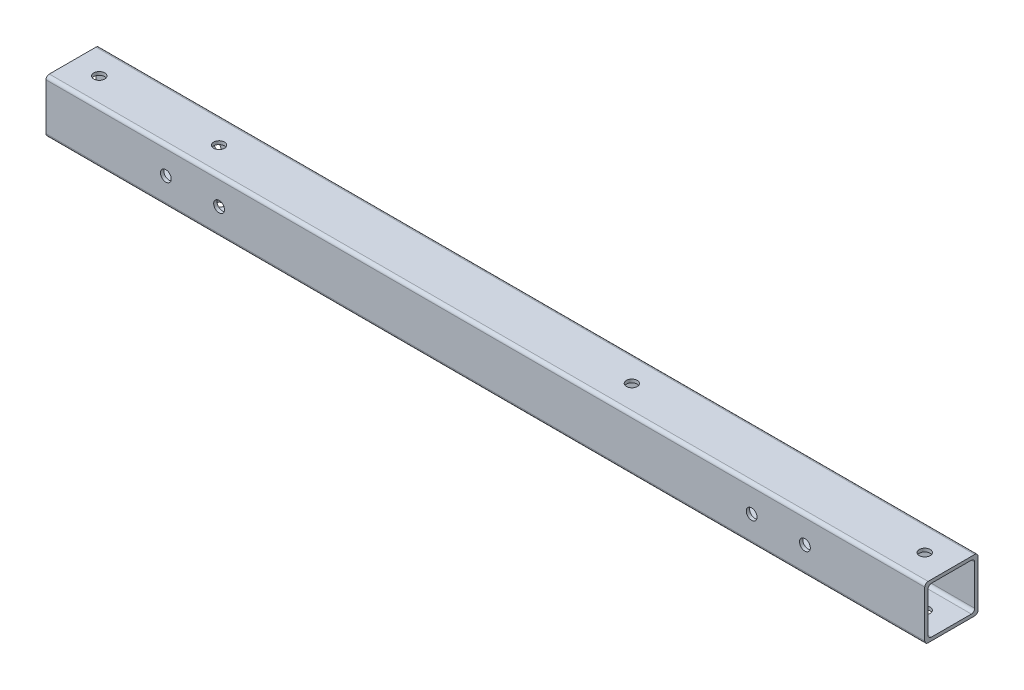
ISO-10303-21;
HEADER;
FILE_DESCRIPTION(('STEP AP214'),'2;1');
FILE_NAME('part.step','',(''),(''),'','','');
FILE_SCHEMA(('AUTOMOTIVE_DESIGN { 1 0 10303 214 1 1 1 1 }'));
ENDSEC;
DATA;
#1=APPLICATION_CONTEXT('core data for automotive mechanical design processes');
#2=APPLICATION_PROTOCOL_DEFINITION('international standard','automotive_design',2000,#1);
#3=PRODUCT_CONTEXT('',#1,'mechanical');
#4=PRODUCT('Part','Part','',(#3));
#5=PRODUCT_RELATED_PRODUCT_CATEGORY('part','',(#4));
#6=PRODUCT_DEFINITION_FORMATION('','',#4);
#7=PRODUCT_DEFINITION_CONTEXT('part definition',#1,'design');
#8=PRODUCT_DEFINITION('design','',#6,#7);
#9=PRODUCT_DEFINITION_SHAPE('','',#8);
#10=(LENGTH_UNIT() NAMED_UNIT(*) SI_UNIT(.MILLI.,.METRE.));
#11=(NAMED_UNIT(*) PLANE_ANGLE_UNIT() SI_UNIT($,.RADIAN.));
#12=(NAMED_UNIT(*) SI_UNIT($,.STERADIAN.) SOLID_ANGLE_UNIT());
#13=UNCERTAINTY_MEASURE_WITH_UNIT(LENGTH_MEASURE(1.E-05),#10,'distance_accuracy_value','');
#14=(GEOMETRIC_REPRESENTATION_CONTEXT(3) GLOBAL_UNCERTAINTY_ASSIGNED_CONTEXT((#13)) GLOBAL_UNIT_ASSIGNED_CONTEXT((#10,
#11,#12)) REPRESENTATION_CONTEXT('',''));
#15=CARTESIAN_POINT('',(0.,0.,0.));
#16=DIRECTION('',(0.,0.,1.));
#17=DIRECTION('',(1.,0.,0.));
#18=AXIS2_PLACEMENT_3D('',#15,#16,#17);
#19=CARTESIAN_POINT('',(0.,101.6,0.));
#20=DIRECTION('',(0.,0.,1.));
#21=DIRECTION('',(1.,0.,0.));
#22=AXIS2_PLACEMENT_3D('',#19,#20,#21);
#23=PLANE('',#22);
#24=CARTESIAN_POINT('',(-228.6,50.8,1.77298507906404E-13));
#25=DIRECTION('',(0.,0.,1.));
#26=DIRECTION('',(1.,0.,0.));
#27=AXIS2_PLACEMENT_3D('',#24,#25,#26);
#28=CIRCLE('',#27,10.31875);
#29=CARTESIAN_POINT('',(-218.28125,50.8,1.78562148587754E-13));
#30=VERTEX_POINT('',#29);
#31=EDGE_CURVE('E238',#30,#30,#28,.T.);
#32=ORIENTED_EDGE('',*,*,#31,.T.);
#33=EDGE_LOOP('',(#32));
#34=FACE_BOUND('',#33,.T.);
#35=CARTESIAN_POINT('',(-1346.2,50.8,1.64856507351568E-13));
#36=DIRECTION('',(0.,0.,-1.));
#37=DIRECTION('',(-1.,0.,0.));
#38=AXIS2_PLACEMENT_3D('',#35,#36,#37);
#39=CIRCLE('',#38,10.31875);
#40=CARTESIAN_POINT('',(-1356.51875,50.8,1.66120148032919E-13));
#41=VERTEX_POINT('',#40);
#42=EDGE_CURVE('E252',#41,#41,#39,.T.);
#43=ORIENTED_EDGE('',*,*,#42,.F.);
#44=EDGE_LOOP('',(#43));
#45=FACE_BOUND('',#44,.T.);
#46=CARTESIAN_POINT('',(-1447.8,50.8,1.77298507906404E-13));
#47=DIRECTION('',(0.,0.,-1.));
#48=DIRECTION('',(-1.,0.,0.));
#49=AXIS2_PLACEMENT_3D('',#46,#47,#48);
#50=CIRCLE('',#49,10.31875);
#51=CARTESIAN_POINT('',(-1458.11875,50.8,1.78562148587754E-13));
#52=VERTEX_POINT('',#51);
#53=EDGE_CURVE('E259',#52,#52,#50,.T.);
#54=ORIENTED_EDGE('',*,*,#53,.F.);
#55=EDGE_LOOP('',(#54));
#56=FACE_BOUND('',#55,.T.);
#57=DIRECTION('',(0.,-1.,0.));
#58=VECTOR('',#57,1.);
#59=CARTESIAN_POINT('',(-1676.4,101.6,2.05293009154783E-13));
#60=LINE('',#59,#58);
#61=CARTESIAN_POINT('',(-1676.4,95.25,2.05293009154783E-13));
#62=VERTEX_POINT('',#61);
#63=CARTESIAN_POINT('',(-1676.4,6.34999999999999,2.05293009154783E-13));
#64=VERTEX_POINT('',#63);
#65=EDGE_CURVE('E310',#62,#64,#60,.T.);
#66=ORIENTED_EDGE('',*,*,#65,.F.);
#67=DIRECTION('',(-1.,0.,0.));
#68=VECTOR('',#67,1.);
#69=CARTESIAN_POINT('',(0.,95.25,0.));
#70=LINE('',#69,#68);
#71=CARTESIAN_POINT('',(0.,95.25,0.));
#72=VERTEX_POINT('',#71);
#73=EDGE_CURVE('E361',#62,#72,#70,.F.);
#74=ORIENTED_EDGE('',*,*,#73,.T.);
#75=DIRECTION('',(0.,-1.,0.));
#76=VECTOR('',#75,1.);
#77=CARTESIAN_POINT('',(0.,101.6,0.));
#78=LINE('',#77,#76);
#79=CARTESIAN_POINT('',(0.,6.34999999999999,0.));
#80=VERTEX_POINT('',#79);
#81=EDGE_CURVE('E160',#72,#80,#78,.T.);
#82=ORIENTED_EDGE('',*,*,#81,.T.);
#83=DIRECTION('',(-1.,0.,0.));
#84=VECTOR('',#83,1.);
#85=CARTESIAN_POINT('',(-1676.4,6.34999999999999,2.05293009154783E-13));
#86=LINE('',#85,#84);
#87=EDGE_CURVE('E359',#80,#64,#86,.T.);
#88=ORIENTED_EDGE('',*,*,#87,.T.);
#89=EDGE_LOOP('',(#66,#74,#82,#88));
#90=FACE_BOUND('',#89,.T.);
#91=CARTESIAN_POINT('',(-330.2,50.8,1.64856507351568E-13));
#92=DIRECTION('',(0.,0.,1.));
#93=DIRECTION('',(1.,0.,0.));
#94=AXIS2_PLACEMENT_3D('',#91,#92,#93);
#95=CIRCLE('',#94,10.31875);
#96=CARTESIAN_POINT('',(-319.88125,50.8,1.66120148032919E-13));
#97=VERTEX_POINT('',#96);
#98=EDGE_CURVE('E219',#97,#97,#95,.T.);
#99=ORIENTED_EDGE('',*,*,#98,.T.);
#100=EDGE_LOOP('',(#99));
#101=FACE_BOUND('',#100,.T.);
#102=ADVANCED_FACE('F31',(#34,#45,#56,#90,#101),#23,.F.);
#103=CARTESIAN_POINT('',(0.,101.6,101.6));
#104=DIRECTION('',(0.,0.,-1.));
#105=DIRECTION('',(-1.,0.,0.));
#106=AXIS2_PLACEMENT_3D('',#103,#104,#105);
#107=PLANE('',#106);
#108=CARTESIAN_POINT('',(-228.6,50.8,101.6));
#109=DIRECTION('',(0.,0.,1.));
#110=DIRECTION('',(1.,0.,0.));
#111=AXIS2_PLACEMENT_3D('',#108,#109,#110);
#112=CIRCLE('',#111,10.31875);
#113=CARTESIAN_POINT('',(-218.28125,50.8,101.6));
#114=VERTEX_POINT('',#113);
#115=EDGE_CURVE('E207',#114,#114,#112,.T.);
#116=ORIENTED_EDGE('',*,*,#115,.F.);
#117=EDGE_LOOP('',(#116));
#118=FACE_BOUND('',#117,.T.);
#119=CARTESIAN_POINT('',(-1346.2,50.8,101.6));
#120=DIRECTION('',(0.,0.,-1.));
#121=DIRECTION('',(-1.,0.,0.));
#122=AXIS2_PLACEMENT_3D('',#119,#120,#121);
#123=CIRCLE('',#122,10.31875);
#124=CARTESIAN_POINT('',(-1356.51875,50.8,101.6));
#125=VERTEX_POINT('',#124);
#126=EDGE_CURVE('E197',#125,#125,#123,.T.);
#127=ORIENTED_EDGE('',*,*,#126,.T.);
#128=EDGE_LOOP('',(#127));
#129=FACE_BOUND('',#128,.T.);
#130=CARTESIAN_POINT('',(-1447.8,50.8,101.6));
#131=DIRECTION('',(0.,0.,-1.));
#132=DIRECTION('',(-1.,0.,0.));
#133=AXIS2_PLACEMENT_3D('',#130,#131,#132);
#134=CIRCLE('',#133,10.31875);
#135=CARTESIAN_POINT('',(-1458.11875,50.8,101.6));
#136=VERTEX_POINT('',#135);
#137=EDGE_CURVE('E192',#136,#136,#134,.T.);
#138=ORIENTED_EDGE('',*,*,#137,.T.);
#139=EDGE_LOOP('',(#138));
#140=FACE_BOUND('',#139,.T.);
#141=DIRECTION('',(0.,-1.,0.));
#142=VECTOR('',#141,1.);
#143=CARTESIAN_POINT('',(-1676.4,101.6,101.6));
#144=LINE('',#143,#142);
#145=CARTESIAN_POINT('',(-1676.4,95.25,101.6));
#146=VERTEX_POINT('',#145);
#147=CARTESIAN_POINT('',(-1676.4,6.34999999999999,101.6));
#148=VERTEX_POINT('',#147);
#149=EDGE_CURVE('E307',#146,#148,#144,.T.);
#150=ORIENTED_EDGE('',*,*,#149,.T.);
#151=DIRECTION('',(1.,0.,0.));
#152=VECTOR('',#151,1.);
#153=CARTESIAN_POINT('',(0.,6.34999999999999,101.6));
#154=LINE('',#153,#152);
#155=CARTESIAN_POINT('',(0.,6.34999999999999,101.6));
#156=VERTEX_POINT('',#155);
#157=EDGE_CURVE('E324',#148,#156,#154,.T.);
#158=ORIENTED_EDGE('',*,*,#157,.T.);
#159=DIRECTION('',(0.,-1.,0.));
#160=VECTOR('',#159,1.);
#161=CARTESIAN_POINT('',(0.,101.6,101.6));
#162=LINE('',#161,#160);
#163=CARTESIAN_POINT('',(0.,95.25,101.6));
#164=VERTEX_POINT('',#163);
#165=EDGE_CURVE('E300',#164,#156,#162,.T.);
#166=ORIENTED_EDGE('',*,*,#165,.F.);
#167=DIRECTION('',(1.,0.,0.));
#168=VECTOR('',#167,1.);
#169=CARTESIAN_POINT('',(0.,95.25,101.6));
#170=LINE('',#169,#168);
#171=EDGE_CURVE('E322',#164,#146,#170,.F.);
#172=ORIENTED_EDGE('',*,*,#171,.T.);
#173=EDGE_LOOP('',(#150,#158,#166,#172));
#174=FACE_BOUND('',#173,.T.);
#175=CARTESIAN_POINT('',(-330.2,50.8,101.6));
#176=DIRECTION('',(0.,0.,1.));
#177=DIRECTION('',(1.,0.,0.));
#178=AXIS2_PLACEMENT_3D('',#175,#176,#177);
#179=CIRCLE('',#178,10.31875);
#180=CARTESIAN_POINT('',(-319.88125,50.8,101.6));
#181=VERTEX_POINT('',#180);
#182=EDGE_CURVE('E211',#181,#181,#179,.T.);
#183=ORIENTED_EDGE('',*,*,#182,.F.);
#184=EDGE_LOOP('',(#183));
#185=FACE_BOUND('',#184,.T.);
#186=ADVANCED_FACE('F390',(#118,#129,#140,#174,#185),#107,.F.);
#187=CARTESIAN_POINT('',(0.000999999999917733,95.25,6.35000000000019));
#188=DIRECTION('',(0.,0.,-1.));
#189=DIRECTION('',(0.,1.,0.));
#190=AXIS2_PLACEMENT_3D('',#187,#188,#189);
#191=PLANE('',#190);
#192=CARTESIAN_POINT('',(-228.6,50.8,6.3500000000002));
#193=DIRECTION('',(0.,0.,-1.));
#194=DIRECTION('',(0.,1.,0.));
#195=AXIS2_PLACEMENT_3D('',#192,#193,#194);
#196=CIRCLE('',#195,10.31875);
#197=CARTESIAN_POINT('',(-228.6,61.11875,6.3500000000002));
#198=VERTEX_POINT('',#197);
#199=EDGE_CURVE('E206',#198,#198,#196,.F.);
#200=ORIENTED_EDGE('',*,*,#199,.F.);
#201=EDGE_LOOP('',(#200));
#202=FACE_BOUND('',#201,.T.);
#203=CARTESIAN_POINT('',(-1346.2,50.8,6.3500000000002));
#204=DIRECTION('',(0.,0.,-1.));
#205=DIRECTION('',(0.,1.,0.));
#206=AXIS2_PLACEMENT_3D('',#203,#204,#205);
#207=CIRCLE('',#206,10.31875);
#208=CARTESIAN_POINT('',(-1346.2,61.11875,6.3500000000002));
#209=VERTEX_POINT('',#208);
#210=EDGE_CURVE('E196',#209,#209,#207,.T.);
#211=ORIENTED_EDGE('',*,*,#210,.T.);
#212=EDGE_LOOP('',(#211));
#213=FACE_BOUND('',#212,.T.);
#214=CARTESIAN_POINT('',(-1447.8,50.8,6.3500000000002));
#215=DIRECTION('',(0.,0.,-1.));
#216=DIRECTION('',(0.,1.,0.));
#217=AXIS2_PLACEMENT_3D('',#214,#215,#216);
#218=CIRCLE('',#217,10.31875);
#219=CARTESIAN_POINT('',(-1447.8,61.11875,6.3500000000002));
#220=VERTEX_POINT('',#219);
#221=EDGE_CURVE('E191',#220,#220,#218,.T.);
#222=ORIENTED_EDGE('',*,*,#221,.T.);
#223=EDGE_LOOP('',(#222));
#224=FACE_BOUND('',#223,.T.);
#225=DIRECTION('',(0.,1.,0.));
#226=VECTOR('',#225,1.);
#227=CARTESIAN_POINT('',(0.,95.25,6.35000000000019));
#228=LINE('',#227,#226);
#229=CARTESIAN_POINT('',(0.,12.7,6.3500000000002));
#230=VERTEX_POINT('',#229);
#231=CARTESIAN_POINT('',(0.,88.9,6.35000000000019));
#232=VERTEX_POINT('',#231);
#233=EDGE_CURVE('E276',#230,#232,#228,.T.);
#234=ORIENTED_EDGE('',*,*,#233,.T.);
#235=DIRECTION('',(-1.,0.,0.));
#236=VECTOR('',#235,1.);
#237=CARTESIAN_POINT('',(-1676.4,88.9,6.35000000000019));
#238=LINE('',#237,#236);
#239=CARTESIAN_POINT('',(-1676.4,88.9,6.35000000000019));
#240=VERTEX_POINT('',#239);
#241=EDGE_CURVE('E356',#232,#240,#238,.T.);
#242=ORIENTED_EDGE('',*,*,#241,.T.);
#243=DIRECTION('',(0.,-1.,0.));
#244=VECTOR('',#243,1.);
#245=CARTESIAN_POINT('',(-1676.4,95.25,6.35000000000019));
#246=LINE('',#245,#244);
#247=CARTESIAN_POINT('',(-1676.4,12.7,6.3500000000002));
#248=VERTEX_POINT('',#247);
#249=EDGE_CURVE('E279',#240,#248,#246,.T.);
#250=ORIENTED_EDGE('',*,*,#249,.T.);
#251=DIRECTION('',(-1.,0.,0.));
#252=VECTOR('',#251,1.);
#253=CARTESIAN_POINT('',(0.,12.7,6.3500000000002));
#254=LINE('',#253,#252);
#255=EDGE_CURVE('E354',#248,#230,#254,.F.);
#256=ORIENTED_EDGE('',*,*,#255,.T.);
#257=EDGE_LOOP('',(#234,#242,#250,#256));
#258=FACE_BOUND('',#257,.T.);
#259=CARTESIAN_POINT('',(-330.2,50.8,6.3500000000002));
#260=DIRECTION('',(0.,0.,-1.));
#261=DIRECTION('',(0.,1.,0.));
#262=AXIS2_PLACEMENT_3D('',#259,#260,#261);
#263=CIRCLE('',#262,10.31875);
#264=CARTESIAN_POINT('',(-330.2,61.11875,6.3500000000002));
#265=VERTEX_POINT('',#264);
#266=EDGE_CURVE('E210',#265,#265,#263,.F.);
#267=ORIENTED_EDGE('',*,*,#266,.F.);
#268=EDGE_LOOP('',(#267));
#269=FACE_BOUND('',#268,.T.);
#270=ADVANCED_FACE('F396',(#202,#213,#224,#258,#269),#191,.F.);
#271=CARTESIAN_POINT('',(0.000999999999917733,95.25,95.2500000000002));
#272=DIRECTION('',(0.,0.,1.));
#273=DIRECTION('',(0.,-1.,0.));
#274=AXIS2_PLACEMENT_3D('',#271,#272,#273);
#275=PLANE('',#274);
#276=CARTESIAN_POINT('',(-228.6,50.8,95.2500000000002));
#277=DIRECTION('',(0.,0.,1.));
#278=DIRECTION('',(0.,-1.,0.));
#279=AXIS2_PLACEMENT_3D('',#276,#277,#278);
#280=CIRCLE('',#279,10.31875);
#281=CARTESIAN_POINT('',(-228.6,40.48125,95.2500000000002));
#282=VERTEX_POINT('',#281);
#283=EDGE_CURVE('E203',#282,#282,#280,.F.);
#284=ORIENTED_EDGE('',*,*,#283,.F.);
#285=EDGE_LOOP('',(#284));
#286=FACE_BOUND('',#285,.T.);
#287=CARTESIAN_POINT('',(-1346.2,50.8,95.2500000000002));
#288=DIRECTION('',(0.,0.,1.));
#289=DIRECTION('',(0.,-1.,0.));
#290=AXIS2_PLACEMENT_3D('',#287,#288,#289);
#291=CIRCLE('',#290,10.31875);
#292=CARTESIAN_POINT('',(-1346.2,40.48125,95.2500000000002));
#293=VERTEX_POINT('',#292);
#294=EDGE_CURVE('E193',#293,#293,#291,.T.);
#295=ORIENTED_EDGE('',*,*,#294,.T.);
#296=EDGE_LOOP('',(#295));
#297=FACE_BOUND('',#296,.T.);
#298=CARTESIAN_POINT('',(-1447.8,50.8,95.2500000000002));
#299=DIRECTION('',(0.,0.,1.));
#300=DIRECTION('',(0.,-1.,0.));
#301=AXIS2_PLACEMENT_3D('',#298,#299,#300);
#302=CIRCLE('',#301,10.31875);
#303=CARTESIAN_POINT('',(-1447.8,40.48125,95.2500000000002));
#304=VERTEX_POINT('',#303);
#305=EDGE_CURVE('E188',#304,#304,#302,.T.);
#306=ORIENTED_EDGE('',*,*,#305,.T.);
#307=EDGE_LOOP('',(#306));
#308=FACE_BOUND('',#307,.T.);
#309=DIRECTION('',(0.,-1.,0.));
#310=VECTOR('',#309,1.);
#311=CARTESIAN_POINT('',(0.,95.25,95.2500000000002));
#312=LINE('',#311,#310);
#313=CARTESIAN_POINT('',(0.,88.9,95.2500000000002));
#314=VERTEX_POINT('',#313);
#315=CARTESIAN_POINT('',(0.,12.7,95.2500000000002));
#316=VERTEX_POINT('',#315);
#317=EDGE_CURVE('E153',#314,#316,#312,.T.);
#318=ORIENTED_EDGE('',*,*,#317,.T.);
#319=DIRECTION('',(-1.,0.,0.));
#320=VECTOR('',#319,1.);
#321=CARTESIAN_POINT('',(-1676.4,12.7,95.2500000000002));
#322=LINE('',#321,#320);
#323=CARTESIAN_POINT('',(-1676.4,12.7,95.2500000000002));
#324=VERTEX_POINT('',#323);
#325=EDGE_CURVE('E159',#316,#324,#322,.T.);
#326=ORIENTED_EDGE('',*,*,#325,.T.);
#327=DIRECTION('',(0.,1.,0.));
#328=VECTOR('',#327,1.);
#329=CARTESIAN_POINT('',(-1676.4,95.25,95.2500000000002));
#330=LINE('',#329,#328);
#331=CARTESIAN_POINT('',(-1676.4,88.9,95.2500000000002));
#332=VERTEX_POINT('',#331);
#333=EDGE_CURVE('E156',#324,#332,#330,.T.);
#334=ORIENTED_EDGE('',*,*,#333,.T.);
#335=DIRECTION('',(-1.,0.,0.));
#336=VECTOR('',#335,1.);
#337=CARTESIAN_POINT('',(0.,88.9,95.2500000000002));
#338=LINE('',#337,#336);
#339=EDGE_CURVE('E148',#332,#314,#338,.F.);
#340=ORIENTED_EDGE('',*,*,#339,.T.);
#341=EDGE_LOOP('',(#318,#326,#334,#340));
#342=FACE_BOUND('',#341,.T.);
#343=CARTESIAN_POINT('',(-330.2,50.8,95.2500000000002));
#344=DIRECTION('',(0.,0.,1.));
#345=DIRECTION('',(0.,-1.,0.));
#346=AXIS2_PLACEMENT_3D('',#343,#344,#345);
#347=CIRCLE('',#346,10.31875);
#348=CARTESIAN_POINT('',(-330.2,40.48125,95.2500000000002));
#349=VERTEX_POINT('',#348);
#350=EDGE_CURVE('E208',#349,#349,#347,.F.);
#351=ORIENTED_EDGE('',*,*,#350,.F.);
#352=EDGE_LOOP('',(#351));
#353=FACE_BOUND('',#352,.T.);
#354=ADVANCED_FACE('F150',(#286,#297,#308,#342,#353),#275,.F.);
#355=CARTESIAN_POINT('',(0.,101.6,0.));
#356=DIRECTION('',(0.,-1.,0.));
#357=DIRECTION('',(0.,0.,-1.));
#358=AXIS2_PLACEMENT_3D('',#355,#356,#357);
#359=PLANE('',#358);
#360=CARTESIAN_POINT('',(-1397.,101.6,50.8000000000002));
#361=DIRECTION('',(0.,1.,0.));
#362=DIRECTION('',(0.,0.,1.));
#363=AXIS2_PLACEMENT_3D('',#360,#361,#362);
#364=CIRCLE('',#363,10.31875);
#365=CARTESIAN_POINT('',(-1397.,101.6,61.1187500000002));
#366=VERTEX_POINT('',#365);
#367=EDGE_CURVE('E509',#366,#366,#364,.T.);
#368=ORIENTED_EDGE('',*,*,#367,.F.);
#369=EDGE_LOOP('',(#368));
#370=FACE_BOUND('',#369,.T.);
#371=CARTESIAN_POINT('',(-609.6,101.6,50.8000000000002));
#372=DIRECTION('',(0.,1.,0.));
#373=DIRECTION('',(0.,0.,1.));
#374=AXIS2_PLACEMENT_3D('',#371,#372,#373);
#375=CIRCLE('',#374,10.31875);
#376=CARTESIAN_POINT('',(-609.6,101.6,61.1187500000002));
#377=VERTEX_POINT('',#376);
#378=EDGE_CURVE('E222',#377,#377,#375,.T.);
#379=ORIENTED_EDGE('',*,*,#378,.F.);
#380=EDGE_LOOP('',(#379));
#381=FACE_BOUND('',#380,.T.);
#382=DIRECTION('',(0.,0.,1.));
#383=VECTOR('',#382,1.);
#384=CARTESIAN_POINT('',(-1676.4,101.6,2.05293009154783E-13));
#385=LINE('',#384,#383);
#386=CARTESIAN_POINT('',(-1676.4,101.6,6.3500000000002));
#387=VERTEX_POINT('',#386);
#388=CARTESIAN_POINT('',(-1676.4,101.6,95.2500000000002));
#389=VERTEX_POINT('',#388);
#390=EDGE_CURVE('E296',#387,#389,#385,.T.);
#391=ORIENTED_EDGE('',*,*,#390,.T.);
#392=DIRECTION('',(1.,0.,0.));
#393=VECTOR('',#392,1.);
#394=CARTESIAN_POINT('',(0.,101.6,95.25));
#395=LINE('',#394,#393);
#396=CARTESIAN_POINT('',(0.,101.6,95.25));
#397=VERTEX_POINT('',#396);
#398=EDGE_CURVE('E348',#389,#397,#395,.T.);
#399=ORIENTED_EDGE('',*,*,#398,.T.);
#400=DIRECTION('',(0.,0.,-1.));
#401=VECTOR('',#400,1.);
#402=CARTESIAN_POINT('',(0.,101.6,0.));
#403=LINE('',#402,#401);
#404=CARTESIAN_POINT('',(0.,101.6,6.35));
#405=VERTEX_POINT('',#404);
#406=EDGE_CURVE('E293',#397,#405,#403,.T.);
#407=ORIENTED_EDGE('',*,*,#406,.T.);
#408=DIRECTION('',(-1.,0.,0.));
#409=VECTOR('',#408,1.);
#410=CARTESIAN_POINT('',(0.,101.6,6.35));
#411=LINE('',#410,#409);
#412=EDGE_CURVE('E345',#405,#387,#411,.T.);
#413=ORIENTED_EDGE('',*,*,#412,.T.);
#414=EDGE_LOOP('',(#391,#399,#407,#413));
#415=FACE_BOUND('',#414,.T.);
#416=CARTESIAN_POINT('',(-1625.6,101.6,50.8000000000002));
#417=DIRECTION('',(0.,1.,0.));
#418=DIRECTION('',(0.,0.,1.));
#419=AXIS2_PLACEMENT_3D('',#416,#417,#418);
#420=CIRCLE('',#419,10.31875);
#421=CARTESIAN_POINT('',(-1625.6,101.6,61.1187500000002));
#422=VERTEX_POINT('',#421);
#423=EDGE_CURVE('E266',#422,#422,#420,.T.);
#424=ORIENTED_EDGE('',*,*,#423,.F.);
#425=EDGE_LOOP('',(#424));
#426=FACE_BOUND('',#425,.T.);
#427=CARTESIAN_POINT('',(-50.8,101.6,50.8000000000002));
#428=DIRECTION('',(0.,-1.,0.));
#429=DIRECTION('',(0.,0.,1.));
#430=AXIS2_PLACEMENT_3D('',#427,#428,#429);
#431=CIRCLE('',#430,10.31875);
#432=CARTESIAN_POINT('',(-50.8,101.6,61.1187500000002));
#433=VERTEX_POINT('',#432);
#434=EDGE_CURVE('E245',#433,#433,#431,.T.);
#435=ORIENTED_EDGE('',*,*,#434,.T.);
#436=EDGE_LOOP('',(#435));
#437=FACE_BOUND('',#436,.T.);
#438=ADVANCED_FACE('F421',(#370,#381,#415,#426,#437),#359,.F.);
#439=CARTESIAN_POINT('',(0.,0.,0.));
#440=DIRECTION('',(0.,-1.,0.));
#441=DIRECTION('',(0.,0.,-1.));
#442=AXIS2_PLACEMENT_3D('',#439,#440,#441);
#443=PLANE('',#442);
#444=CARTESIAN_POINT('',(-1397.,0.,50.8000000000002));
#445=DIRECTION('',(0.,1.,0.));
#446=DIRECTION('',(0.,0.,1.));
#447=AXIS2_PLACEMENT_3D('',#444,#445,#446);
#448=CIRCLE('',#447,10.31875);
#449=CARTESIAN_POINT('',(-1397.,0.,61.1187500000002));
#450=VERTEX_POINT('',#449);
#451=EDGE_CURVE('E431',#450,#450,#448,.T.);
#452=ORIENTED_EDGE('',*,*,#451,.T.);
#453=EDGE_LOOP('',(#452));
#454=FACE_BOUND('',#453,.T.);
#455=CARTESIAN_POINT('',(-609.6,0.,50.8000000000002));
#456=DIRECTION('',(0.,1.,0.));
#457=DIRECTION('',(0.,0.,1.));
#458=AXIS2_PLACEMENT_3D('',#455,#456,#457);
#459=CIRCLE('',#458,10.31875);
#460=CARTESIAN_POINT('',(-609.6,0.,61.1187500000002));
#461=VERTEX_POINT('',#460);
#462=EDGE_CURVE('E215',#461,#461,#459,.T.);
#463=ORIENTED_EDGE('',*,*,#462,.T.);
#464=EDGE_LOOP('',(#463));
#465=FACE_BOUND('',#464,.T.);
#466=DIRECTION('',(0.,0.,-1.));
#467=VECTOR('',#466,1.);
#468=CARTESIAN_POINT('',(0.,0.,0.));
#469=LINE('',#468,#467);
#470=CARTESIAN_POINT('',(0.,0.,95.25));
#471=VERTEX_POINT('',#470);
#472=CARTESIAN_POINT('',(0.,0.,6.35));
#473=VERTEX_POINT('',#472);
#474=EDGE_CURVE('E292',#471,#473,#469,.T.);
#475=ORIENTED_EDGE('',*,*,#474,.F.);
#476=DIRECTION('',(1.,0.,0.));
#477=VECTOR('',#476,1.);
#478=CARTESIAN_POINT('',(-1676.4,0.,95.2500000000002));
#479=LINE('',#478,#477);
#480=CARTESIAN_POINT('',(-1676.4,0.,95.2500000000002));
#481=VERTEX_POINT('',#480);
#482=EDGE_CURVE('E337',#471,#481,#479,.F.);
#483=ORIENTED_EDGE('',*,*,#482,.T.);
#484=DIRECTION('',(0.,0.,1.));
#485=VECTOR('',#484,1.);
#486=CARTESIAN_POINT('',(-1676.4,0.,2.05293009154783E-13));
#487=LINE('',#486,#485);
#488=CARTESIAN_POINT('',(-1676.4,0.,6.3500000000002));
#489=VERTEX_POINT('',#488);
#490=EDGE_CURVE('E297',#489,#481,#487,.T.);
#491=ORIENTED_EDGE('',*,*,#490,.F.);
#492=DIRECTION('',(-1.,0.,0.));
#493=VECTOR('',#492,1.);
#494=CARTESIAN_POINT('',(0.,0.,6.35));
#495=LINE('',#494,#493);
#496=EDGE_CURVE('E335',#489,#473,#495,.F.);
#497=ORIENTED_EDGE('',*,*,#496,.T.);
#498=EDGE_LOOP('',(#475,#483,#491,#497));
#499=FACE_BOUND('',#498,.T.);
#500=CARTESIAN_POINT('',(-1625.6,0.,50.8000000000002));
#501=DIRECTION('',(0.,1.,0.));
#502=DIRECTION('',(0.,0.,1.));
#503=AXIS2_PLACEMENT_3D('',#500,#501,#502);
#504=CIRCLE('',#503,10.31875);
#505=CARTESIAN_POINT('',(-1625.6,0.,61.1187500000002));
#506=VERTEX_POINT('',#505);
#507=EDGE_CURVE('E267',#506,#506,#504,.T.);
#508=ORIENTED_EDGE('',*,*,#507,.T.);
#509=EDGE_LOOP('',(#508));
#510=FACE_BOUND('',#509,.T.);
#511=CARTESIAN_POINT('',(-50.8,0.,50.8000000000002));
#512=DIRECTION('',(0.,-1.,0.));
#513=DIRECTION('',(0.,0.,1.));
#514=AXIS2_PLACEMENT_3D('',#511,#512,#513);
#515=CIRCLE('',#514,10.31875);
#516=CARTESIAN_POINT('',(-50.8,0.,61.1187500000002));
#517=VERTEX_POINT('',#516);
#518=EDGE_CURVE('E202',#517,#517,#515,.T.);
#519=ORIENTED_EDGE('',*,*,#518,.F.);
#520=EDGE_LOOP('',(#519));
#521=FACE_BOUND('',#520,.T.);
#522=ADVANCED_FACE('F412',(#454,#465,#499,#510,#521),#443,.T.);
#523=CARTESIAN_POINT('',(0.000999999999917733,95.25,6.35000000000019));
#524=DIRECTION('',(0.,1.,0.));
#525=DIRECTION('',(0.,0.,1.));
#526=AXIS2_PLACEMENT_3D('',#523,#524,#525);
#527=PLANE('',#526);
#528=CARTESIAN_POINT('',(-1397.,95.25,50.8000000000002));
#529=DIRECTION('',(0.,1.,0.));
#530=DIRECTION('',(0.,0.,1.));
#531=AXIS2_PLACEMENT_3D('',#528,#529,#530);
#532=CIRCLE('',#531,10.31875);
#533=CARTESIAN_POINT('',(-1397.,95.25,61.1187500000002));
#534=VERTEX_POINT('',#533);
#535=EDGE_CURVE('E227',#534,#534,#532,.T.);
#536=ORIENTED_EDGE('',*,*,#535,.T.);
#537=EDGE_LOOP('',(#536));
#538=FACE_BOUND('',#537,.T.);
#539=CARTESIAN_POINT('',(-609.6,95.25,50.8000000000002));
#540=DIRECTION('',(0.,1.,0.));
#541=DIRECTION('',(0.,0.,1.));
#542=AXIS2_PLACEMENT_3D('',#539,#540,#541);
#543=CIRCLE('',#542,10.31875);
#544=CARTESIAN_POINT('',(-609.6,95.25,61.1187500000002));
#545=VERTEX_POINT('',#544);
#546=EDGE_CURVE('E214',#545,#545,#543,.T.);
#547=ORIENTED_EDGE('',*,*,#546,.T.);
#548=EDGE_LOOP('',(#547));
#549=FACE_BOUND('',#548,.T.);
#550=DIRECTION('',(0.,0.,1.));
#551=VECTOR('',#550,1.);
#552=CARTESIAN_POINT('',(0.,95.25,6.35000000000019));
#553=LINE('',#552,#551);
#554=CARTESIAN_POINT('',(0.,95.25,12.7000000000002));
#555=VERTEX_POINT('',#554);
#556=CARTESIAN_POINT('',(0.,95.25,88.9000000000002));
#557=VERTEX_POINT('',#556);
#558=EDGE_CURVE('E171',#555,#557,#553,.T.);
#559=ORIENTED_EDGE('',*,*,#558,.T.);
#560=DIRECTION('',(-1.,0.,0.));
#561=VECTOR('',#560,1.);
#562=CARTESIAN_POINT('',(-1676.4,95.25,88.9000000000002));
#563=LINE('',#562,#561);
#564=CARTESIAN_POINT('',(-1676.4,95.25,88.9000000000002));
#565=VERTEX_POINT('',#564);
#566=EDGE_CURVE('E177',#557,#565,#563,.T.);
#567=ORIENTED_EDGE('',*,*,#566,.T.);
#568=DIRECTION('',(0.,0.,-1.));
#569=VECTOR('',#568,1.);
#570=CARTESIAN_POINT('',(-1676.4,95.25,6.35000000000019));
#571=LINE('',#570,#569);
#572=CARTESIAN_POINT('',(-1676.4,95.25,12.7000000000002));
#573=VERTEX_POINT('',#572);
#574=EDGE_CURVE('E286',#565,#573,#571,.T.);
#575=ORIENTED_EDGE('',*,*,#574,.T.);
#576=DIRECTION('',(-1.,0.,0.));
#577=VECTOR('',#576,1.);
#578=CARTESIAN_POINT('',(0.,95.25,12.7000000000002));
#579=LINE('',#578,#577);
#580=EDGE_CURVE('E351',#573,#555,#579,.F.);
#581=ORIENTED_EDGE('',*,*,#580,.T.);
#582=EDGE_LOOP('',(#559,#567,#575,#581));
#583=FACE_BOUND('',#582,.T.);
#584=CARTESIAN_POINT('',(-1625.6,95.25,50.8000000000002));
#585=DIRECTION('',(0.,1.,0.));
#586=DIRECTION('',(0.,0.,1.));
#587=AXIS2_PLACEMENT_3D('',#584,#585,#586);
#588=CIRCLE('',#587,10.31875);
#589=CARTESIAN_POINT('',(-1625.6,95.25,61.1187500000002));
#590=VERTEX_POINT('',#589);
#591=EDGE_CURVE('E172',#590,#590,#588,.T.);
#592=ORIENTED_EDGE('',*,*,#591,.T.);
#593=EDGE_LOOP('',(#592));
#594=FACE_BOUND('',#593,.T.);
#595=CARTESIAN_POINT('',(-50.8,95.25,50.8000000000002));
#596=DIRECTION('',(0.,1.,0.));
#597=DIRECTION('',(0.,0.,1.));
#598=AXIS2_PLACEMENT_3D('',#595,#596,#597);
#599=CIRCLE('',#598,10.31875);
#600=CARTESIAN_POINT('',(-50.8,95.25,61.1187500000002));
#601=VERTEX_POINT('',#600);
#602=EDGE_CURVE('E201',#601,#601,#599,.F.);
#603=ORIENTED_EDGE('',*,*,#602,.F.);
#604=EDGE_LOOP('',(#603));
#605=FACE_BOUND('',#604,.T.);
#606=ADVANCED_FACE('F406',(#538,#549,#583,#594,#605),#527,.F.);
#607=CARTESIAN_POINT('',(0.000999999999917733,6.35,6.35000000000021));
#608=DIRECTION('',(0.,-1.,0.));
#609=DIRECTION('',(0.,0.,-1.));
#610=AXIS2_PLACEMENT_3D('',#607,#608,#609);
#611=PLANE('',#610);
#612=CARTESIAN_POINT('',(-1397.,6.35,50.8000000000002));
#613=DIRECTION('',(0.,-1.,0.));
#614=DIRECTION('',(0.,0.,-1.));
#615=AXIS2_PLACEMENT_3D('',#612,#613,#614);
#616=CIRCLE('',#615,10.31875);
#617=CARTESIAN_POINT('',(-1397.,6.35,40.4812500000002));
#618=VERTEX_POINT('',#617);
#619=EDGE_CURVE('E35',#618,#618,#616,.T.);
#620=ORIENTED_EDGE('',*,*,#619,.T.);
#621=EDGE_LOOP('',(#620));
#622=FACE_BOUND('',#621,.T.);
#623=CARTESIAN_POINT('',(-609.6,6.35,50.8000000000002));
#624=DIRECTION('',(0.,-1.,0.));
#625=DIRECTION('',(0.,0.,-1.));
#626=AXIS2_PLACEMENT_3D('',#623,#624,#625);
#627=CIRCLE('',#626,10.31875);
#628=CARTESIAN_POINT('',(-609.6,6.35,40.4812500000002));
#629=VERTEX_POINT('',#628);
#630=EDGE_CURVE('E212',#629,#629,#627,.T.);
#631=ORIENTED_EDGE('',*,*,#630,.T.);
#632=EDGE_LOOP('',(#631));
#633=FACE_BOUND('',#632,.T.);
#634=DIRECTION('',(0.,0.,1.));
#635=VECTOR('',#634,1.);
#636=CARTESIAN_POINT('',(-1676.4,6.35,6.35000000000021));
#637=LINE('',#636,#635);
#638=CARTESIAN_POINT('',(-1676.4,6.35,12.7000000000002));
#639=VERTEX_POINT('',#638);
#640=CARTESIAN_POINT('',(-1676.4,6.35,88.9000000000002));
#641=VERTEX_POINT('',#640);
#642=EDGE_CURVE('E282',#639,#641,#637,.T.);
#643=ORIENTED_EDGE('',*,*,#642,.T.);
#644=DIRECTION('',(-1.,0.,0.));
#645=VECTOR('',#644,1.);
#646=CARTESIAN_POINT('',(0.,6.35,88.9000000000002));
#647=LINE('',#646,#645);
#648=CARTESIAN_POINT('',(0.,6.35,88.9000000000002));
#649=VERTEX_POINT('',#648);
#650=EDGE_CURVE('E320',#641,#649,#647,.F.);
#651=ORIENTED_EDGE('',*,*,#650,.T.);
#652=DIRECTION('',(0.,0.,-1.));
#653=VECTOR('',#652,1.);
#654=CARTESIAN_POINT('',(0.,6.35,6.35000000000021));
#655=LINE('',#654,#653);
#656=CARTESIAN_POINT('',(0.,6.35,12.7000000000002));
#657=VERTEX_POINT('',#656);
#658=EDGE_CURVE('E289',#649,#657,#655,.T.);
#659=ORIENTED_EDGE('',*,*,#658,.T.);
#660=DIRECTION('',(-1.,0.,0.));
#661=VECTOR('',#660,1.);
#662=CARTESIAN_POINT('',(-1676.4,6.35,12.7000000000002));
#663=LINE('',#662,#661);
#664=EDGE_CURVE('E317',#657,#639,#663,.T.);
#665=ORIENTED_EDGE('',*,*,#664,.T.);
#666=EDGE_LOOP('',(#643,#651,#659,#665));
#667=FACE_BOUND('',#666,.T.);
#668=CARTESIAN_POINT('',(-1625.6,6.35,50.8000000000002));
#669=DIRECTION('',(0.,-1.,0.));
#670=DIRECTION('',(0.,0.,-1.));
#671=AXIS2_PLACEMENT_3D('',#668,#669,#670);
#672=CIRCLE('',#671,10.31875);
#673=CARTESIAN_POINT('',(-1625.6,6.35,40.4812500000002));
#674=VERTEX_POINT('',#673);
#675=EDGE_CURVE('E270',#674,#674,#672,.T.);
#676=ORIENTED_EDGE('',*,*,#675,.T.);
#677=EDGE_LOOP('',(#676));
#678=FACE_BOUND('',#677,.T.);
#679=CARTESIAN_POINT('',(-50.8,6.35,50.8000000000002));
#680=DIRECTION('',(0.,-1.,0.));
#681=DIRECTION('',(0.,0.,-1.));
#682=AXIS2_PLACEMENT_3D('',#679,#680,#681);
#683=CIRCLE('',#682,10.31875);
#684=CARTESIAN_POINT('',(-50.8,6.35,40.4812500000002));
#685=VERTEX_POINT('',#684);
#686=EDGE_CURVE('E198',#685,#685,#683,.F.);
#687=ORIENTED_EDGE('',*,*,#686,.F.);
#688=EDGE_LOOP('',(#687));
#689=FACE_BOUND('',#688,.T.);
#690=ADVANCED_FACE('F370',(#622,#633,#667,#678,#689),#611,.F.);
#691=CARTESIAN_POINT('',(0.,101.6,0.));
#692=DIRECTION('',(-1.,0.,0.));
#693=DIRECTION('',(0.,0.,1.));
#694=AXIS2_PLACEMENT_3D('',#691,#692,#693);
#695=PLANE('',#694);
#696=ORIENTED_EDGE('',*,*,#558,.F.);
#697=CARTESIAN_POINT('',(0.,88.9,12.7000000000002));
#698=DIRECTION('',(-1.,0.,0.));
#699=DIRECTION('',(0.,0.,1.));
#700=AXIS2_PLACEMENT_3D('',#697,#698,#699);
#701=CIRCLE('',#700,6.35);
#702=EDGE_CURVE('E181',#555,#232,#701,.T.);
#703=ORIENTED_EDGE('',*,*,#702,.T.);
#704=ORIENTED_EDGE('',*,*,#233,.F.);
#705=CARTESIAN_POINT('',(0.,12.7,12.7000000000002));
#706=DIRECTION('',(-1.,0.,0.));
#707=DIRECTION('',(0.,0.,1.));
#708=AXIS2_PLACEMENT_3D('',#705,#706,#707);
#709=CIRCLE('',#708,6.35);
#710=EDGE_CURVE('E11',#230,#657,#709,.T.);
#711=ORIENTED_EDGE('',*,*,#710,.T.);
#712=ORIENTED_EDGE('',*,*,#658,.F.);
#713=CARTESIAN_POINT('',(0.,12.7,88.9000000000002));
#714=DIRECTION('',(-1.,0.,0.));
#715=DIRECTION('',(0.,0.,1.));
#716=AXIS2_PLACEMENT_3D('',#713,#714,#715);
#717=CIRCLE('',#716,6.35);
#718=EDGE_CURVE('E170',#649,#316,#717,.T.);
#719=ORIENTED_EDGE('',*,*,#718,.T.);
#720=ORIENTED_EDGE('',*,*,#317,.F.);
#721=CARTESIAN_POINT('',(0.,88.9,88.9000000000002));
#722=DIRECTION('',(-1.,0.,0.));
#723=DIRECTION('',(0.,0.,1.));
#724=AXIS2_PLACEMENT_3D('',#721,#722,#723);
#725=CIRCLE('',#724,6.35);
#726=EDGE_CURVE('E166',#314,#557,#725,.T.);
#727=ORIENTED_EDGE('',*,*,#726,.T.);
#728=EDGE_LOOP('',(#696,#703,#704,#711,#712,#719,#720,#727));
#729=FACE_BOUND('',#728,.T.);
#730=ORIENTED_EDGE('',*,*,#165,.T.);
#731=CARTESIAN_POINT('',(0.,6.34999999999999,95.25));
#732=DIRECTION('',(-1.,0.,0.));
#733=DIRECTION('',(0.,0.,1.));
#734=AXIS2_PLACEMENT_3D('',#731,#732,#733);
#735=CIRCLE('',#734,6.35);
#736=EDGE_CURVE('E333',#156,#471,#735,.F.);
#737=ORIENTED_EDGE('',*,*,#736,.T.);
#738=ORIENTED_EDGE('',*,*,#474,.T.);
#739=CARTESIAN_POINT('',(0.,6.34999999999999,6.35));
#740=DIRECTION('',(-1.,0.,0.));
#741=DIRECTION('',(0.,0.,1.));
#742=AXIS2_PLACEMENT_3D('',#739,#740,#741);
#743=CIRCLE('',#742,6.35);
#744=EDGE_CURVE('E327',#473,#80,#743,.F.);
#745=ORIENTED_EDGE('',*,*,#744,.T.);
#746=ORIENTED_EDGE('',*,*,#81,.F.);
#747=CARTESIAN_POINT('',(0.,95.25,6.35));
#748=DIRECTION('',(-1.,0.,0.));
#749=DIRECTION('',(0.,0.,1.));
#750=AXIS2_PLACEMENT_3D('',#747,#748,#749);
#751=CIRCLE('',#750,6.35);
#752=EDGE_CURVE('E329',#72,#405,#751,.F.);
#753=ORIENTED_EDGE('',*,*,#752,.T.);
#754=ORIENTED_EDGE('',*,*,#406,.F.);
#755=CARTESIAN_POINT('',(0.,95.25,95.25));
#756=DIRECTION('',(-1.,0.,0.));
#757=DIRECTION('',(0.,0.,1.));
#758=AXIS2_PLACEMENT_3D('',#755,#756,#757);
#759=CIRCLE('',#758,6.35);
#760=EDGE_CURVE('E331',#397,#164,#759,.F.);
#761=ORIENTED_EDGE('',*,*,#760,.T.);
#762=EDGE_LOOP('',(#730,#737,#738,#745,#746,#753,#754,#761));
#763=FACE_BOUND('',#762,.T.);
#764=ADVANCED_FACE('F164',(#729,#763),#695,.F.);
#765=CARTESIAN_POINT('',(-1676.4,101.6,2.05293009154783E-13));
#766=DIRECTION('',(1.,0.,0.));
#767=DIRECTION('',(0.,0.,-1.));
#768=AXIS2_PLACEMENT_3D('',#765,#766,#767);
#769=PLANE('',#768);
#770=ORIENTED_EDGE('',*,*,#642,.F.);
#771=CARTESIAN_POINT('',(-1676.4,12.7,12.7000000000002));
#772=DIRECTION('',(1.,0.,0.));
#773=DIRECTION('',(0.,0.,-1.));
#774=AXIS2_PLACEMENT_3D('',#771,#772,#773);
#775=CIRCLE('',#774,6.35);
#776=EDGE_CURVE('E40',#639,#248,#775,.T.);
#777=ORIENTED_EDGE('',*,*,#776,.T.);
#778=ORIENTED_EDGE('',*,*,#249,.F.);
#779=CARTESIAN_POINT('',(-1676.4,88.9,12.7000000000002));
#780=DIRECTION('',(1.,0.,0.));
#781=DIRECTION('',(0.,0.,-1.));
#782=AXIS2_PLACEMENT_3D('',#779,#780,#781);
#783=CIRCLE('',#782,6.35);
#784=EDGE_CURVE('E178',#240,#573,#783,.T.);
#785=ORIENTED_EDGE('',*,*,#784,.T.);
#786=ORIENTED_EDGE('',*,*,#574,.F.);
#787=CARTESIAN_POINT('',(-1676.4,88.9,88.9000000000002));
#788=DIRECTION('',(1.,0.,0.));
#789=DIRECTION('',(0.,0.,-1.));
#790=AXIS2_PLACEMENT_3D('',#787,#788,#789);
#791=CIRCLE('',#790,6.35);
#792=EDGE_CURVE('E179',#565,#332,#791,.T.);
#793=ORIENTED_EDGE('',*,*,#792,.T.);
#794=ORIENTED_EDGE('',*,*,#333,.F.);
#795=CARTESIAN_POINT('',(-1676.4,12.7,88.9000000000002));
#796=DIRECTION('',(1.,0.,0.));
#797=DIRECTION('',(0.,0.,-1.));
#798=AXIS2_PLACEMENT_3D('',#795,#796,#797);
#799=CIRCLE('',#798,6.35);
#800=EDGE_CURVE('E363',#324,#641,#799,.T.);
#801=ORIENTED_EDGE('',*,*,#800,.T.);
#802=EDGE_LOOP('',(#770,#777,#778,#785,#786,#793,#794,#801));
#803=FACE_BOUND('',#802,.T.);
#804=ORIENTED_EDGE('',*,*,#490,.T.);
#805=CARTESIAN_POINT('',(-1676.4,6.34999999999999,95.2500000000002));
#806=DIRECTION('',(1.,0.,0.));
#807=DIRECTION('',(0.,0.,-1.));
#808=AXIS2_PLACEMENT_3D('',#805,#806,#807);
#809=CIRCLE('',#808,6.35);
#810=EDGE_CURVE('E343',#481,#148,#809,.F.);
#811=ORIENTED_EDGE('',*,*,#810,.T.);
#812=ORIENTED_EDGE('',*,*,#149,.F.);
#813=CARTESIAN_POINT('',(-1676.4,95.25,95.2500000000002));
#814=DIRECTION('',(1.,0.,0.));
#815=DIRECTION('',(0.,0.,-1.));
#816=AXIS2_PLACEMENT_3D('',#813,#814,#815);
#817=CIRCLE('',#816,6.35);
#818=EDGE_CURVE('E341',#146,#389,#817,.F.);
#819=ORIENTED_EDGE('',*,*,#818,.T.);
#820=ORIENTED_EDGE('',*,*,#390,.F.);
#821=CARTESIAN_POINT('',(-1676.4,95.25,6.35000000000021));
#822=DIRECTION('',(1.,0.,0.));
#823=DIRECTION('',(0.,0.,-1.));
#824=AXIS2_PLACEMENT_3D('',#821,#822,#823);
#825=CIRCLE('',#824,6.35);
#826=EDGE_CURVE('E56',#387,#62,#825,.F.);
#827=ORIENTED_EDGE('',*,*,#826,.T.);
#828=ORIENTED_EDGE('',*,*,#65,.T.);
#829=CARTESIAN_POINT('',(-1676.4,6.34999999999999,6.35000000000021));
#830=DIRECTION('',(1.,0.,0.));
#831=DIRECTION('',(0.,0.,-1.));
#832=AXIS2_PLACEMENT_3D('',#829,#830,#831);
#833=CIRCLE('',#832,6.35);
#834=EDGE_CURVE('E48',#64,#489,#833,.F.);
#835=ORIENTED_EDGE('',*,*,#834,.T.);
#836=EDGE_LOOP('',(#804,#811,#812,#819,#820,#827,#828,#835));
#837=FACE_BOUND('',#836,.T.);
#838=ADVANCED_FACE('F366',(#803,#837),#769,.F.);
#839=CARTESIAN_POINT('',(-1625.6,0.,50.8000000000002));
#840=DIRECTION('',(0.,1.,0.));
#841=DIRECTION('',(0.,0.,1.));
#842=AXIS2_PLACEMENT_3D('',#839,#840,#841);
#843=CYLINDRICAL_SURFACE('',#842,10.31875);
#844=ORIENTED_EDGE('',*,*,#507,.F.);
#845=EDGE_LOOP('',(#844));
#846=FACE_BOUND('',#845,.T.);
#847=ORIENTED_EDGE('',*,*,#675,.F.);
#848=EDGE_LOOP('',(#847));
#849=FACE_BOUND('',#848,.T.);
#850=ADVANCED_FACE('F385',(#846,#849),#843,.F.);
#851=ORIENTED_EDGE('',*,*,#423,.T.);
#852=EDGE_LOOP('',(#851));
#853=FACE_BOUND('',#852,.T.);
#854=ORIENTED_EDGE('',*,*,#591,.F.);
#855=EDGE_LOOP('',(#854));
#856=FACE_BOUND('',#855,.T.);
#857=ADVANCED_FACE('F376',(#853,#856),#843,.F.);
#858=CARTESIAN_POINT('',(0.000999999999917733,12.7,88.9000000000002));
#859=DIRECTION('',(1.,0.,0.));
#860=DIRECTION('',(0.,0.,-1.));
#861=AXIS2_PLACEMENT_3D('',#858,#859,#860);
#862=CYLINDRICAL_SURFACE('',#861,6.35);
#863=ORIENTED_EDGE('',*,*,#718,.F.);
#864=ORIENTED_EDGE('',*,*,#650,.F.);
#865=ORIENTED_EDGE('',*,*,#800,.F.);
#866=ORIENTED_EDGE('',*,*,#325,.F.);
#867=EDGE_LOOP('',(#863,#864,#865,#866));
#868=FACE_BOUND('',#867,.T.);
#869=ADVANCED_FACE('F373',(#868),#862,.F.);
#870=CARTESIAN_POINT('',(0.,6.34999999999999,95.25));
#871=DIRECTION('',(-1.,0.,0.));
#872=DIRECTION('',(0.,0.,1.));
#873=AXIS2_PLACEMENT_3D('',#870,#871,#872);
#874=CYLINDRICAL_SURFACE('',#873,6.35);
#875=ORIENTED_EDGE('',*,*,#810,.F.);
#876=ORIENTED_EDGE('',*,*,#482,.F.);
#877=ORIENTED_EDGE('',*,*,#736,.F.);
#878=ORIENTED_EDGE('',*,*,#157,.F.);
#879=EDGE_LOOP('',(#875,#876,#877,#878));
#880=FACE_BOUND('',#879,.T.);
#881=ADVANCED_FACE('F375',(#880),#874,.T.);
#882=CARTESIAN_POINT('',(0.,95.25,95.25));
#883=DIRECTION('',(1.,0.,0.));
#884=DIRECTION('',(0.,0.,-1.));
#885=AXIS2_PLACEMENT_3D('',#882,#883,#884);
#886=CYLINDRICAL_SURFACE('',#885,6.35);
#887=ORIENTED_EDGE('',*,*,#818,.F.);
#888=ORIENTED_EDGE('',*,*,#171,.F.);
#889=ORIENTED_EDGE('',*,*,#760,.F.);
#890=ORIENTED_EDGE('',*,*,#398,.F.);
#891=EDGE_LOOP('',(#887,#888,#889,#890));
#892=FACE_BOUND('',#891,.T.);
#893=ADVANCED_FACE('F382',(#892),#886,.T.);
#894=CARTESIAN_POINT('',(0.000999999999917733,88.9,88.9000000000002));
#895=DIRECTION('',(1.,0.,0.));
#896=DIRECTION('',(0.,0.,-1.));
#897=AXIS2_PLACEMENT_3D('',#894,#895,#896);
#898=CYLINDRICAL_SURFACE('',#897,6.35);
#899=ORIENTED_EDGE('',*,*,#726,.F.);
#900=ORIENTED_EDGE('',*,*,#339,.F.);
#901=ORIENTED_EDGE('',*,*,#792,.F.);
#902=ORIENTED_EDGE('',*,*,#566,.F.);
#903=EDGE_LOOP('',(#899,#900,#901,#902));
#904=FACE_BOUND('',#903,.T.);
#905=ADVANCED_FACE('F175',(#904),#898,.F.);
#906=CARTESIAN_POINT('',(0.000999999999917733,88.9,12.7000000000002));
#907=DIRECTION('',(1.,0.,0.));
#908=DIRECTION('',(0.,0.,-1.));
#909=AXIS2_PLACEMENT_3D('',#906,#907,#908);
#910=CYLINDRICAL_SURFACE('',#909,6.35);
#911=ORIENTED_EDGE('',*,*,#702,.F.);
#912=ORIENTED_EDGE('',*,*,#580,.F.);
#913=ORIENTED_EDGE('',*,*,#784,.F.);
#914=ORIENTED_EDGE('',*,*,#241,.F.);
#915=EDGE_LOOP('',(#911,#912,#913,#914));
#916=FACE_BOUND('',#915,.T.);
#917=ADVANCED_FACE('F528',(#916),#910,.F.);
#918=CARTESIAN_POINT('',(0.,95.25,6.35));
#919=DIRECTION('',(-1.,0.,0.));
#920=DIRECTION('',(0.,0.,1.));
#921=AXIS2_PLACEMENT_3D('',#918,#919,#920);
#922=CYLINDRICAL_SURFACE('',#921,6.35);
#923=ORIENTED_EDGE('',*,*,#752,.F.);
#924=ORIENTED_EDGE('',*,*,#73,.F.);
#925=ORIENTED_EDGE('',*,*,#826,.F.);
#926=ORIENTED_EDGE('',*,*,#412,.F.);
#927=EDGE_LOOP('',(#923,#924,#925,#926));
#928=FACE_BOUND('',#927,.T.);
#929=ADVANCED_FACE('F535',(#928),#922,.T.);
#930=CARTESIAN_POINT('',(0.000999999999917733,12.7,12.7000000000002));
#931=DIRECTION('',(1.,0.,0.));
#932=DIRECTION('',(0.,0.,-1.));
#933=AXIS2_PLACEMENT_3D('',#930,#931,#932);
#934=CYLINDRICAL_SURFACE('',#933,6.35);
#935=ORIENTED_EDGE('',*,*,#710,.F.);
#936=ORIENTED_EDGE('',*,*,#255,.F.);
#937=ORIENTED_EDGE('',*,*,#776,.F.);
#938=ORIENTED_EDGE('',*,*,#664,.F.);
#939=EDGE_LOOP('',(#935,#936,#937,#938));
#940=FACE_BOUND('',#939,.T.);
#941=ADVANCED_FACE('F533',(#940),#934,.F.);
#942=CARTESIAN_POINT('',(0.,6.34999999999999,6.35));
#943=DIRECTION('',(1.,0.,0.));
#944=DIRECTION('',(0.,0.,-1.));
#945=AXIS2_PLACEMENT_3D('',#942,#943,#944);
#946=CYLINDRICAL_SURFACE('',#945,6.35);
#947=ORIENTED_EDGE('',*,*,#744,.F.);
#948=ORIENTED_EDGE('',*,*,#496,.F.);
#949=ORIENTED_EDGE('',*,*,#834,.F.);
#950=ORIENTED_EDGE('',*,*,#87,.F.);
#951=EDGE_LOOP('',(#947,#948,#949,#950));
#952=FACE_BOUND('',#951,.T.);
#953=ADVANCED_FACE('F33',(#952),#946,.T.);
#954=CARTESIAN_POINT('',(-1447.8,50.8,101.6));
#955=DIRECTION('',(0.,0.,-1.));
#956=DIRECTION('',(-1.,0.,0.));
#957=AXIS2_PLACEMENT_3D('',#954,#955,#956);
#958=CYLINDRICAL_SURFACE('',#957,10.31875);
#959=ORIENTED_EDGE('',*,*,#137,.F.);
#960=EDGE_LOOP('',(#959));
#961=FACE_BOUND('',#960,.T.);
#962=ORIENTED_EDGE('',*,*,#305,.F.);
#963=EDGE_LOOP('',(#962));
#964=FACE_BOUND('',#963,.T.);
#965=ADVANCED_FACE('F463',(#961,#964),#958,.F.);
#966=ORIENTED_EDGE('',*,*,#53,.T.);
#967=EDGE_LOOP('',(#966));
#968=FACE_BOUND('',#967,.T.);
#969=ORIENTED_EDGE('',*,*,#221,.F.);
#970=EDGE_LOOP('',(#969));
#971=FACE_BOUND('',#970,.T.);
#972=ADVANCED_FACE('F461',(#968,#971),#958,.F.);
#973=CARTESIAN_POINT('',(-1346.2,50.8,101.6));
#974=DIRECTION('',(0.,0.,-1.));
#975=DIRECTION('',(-1.,0.,0.));
#976=AXIS2_PLACEMENT_3D('',#973,#974,#975);
#977=CYLINDRICAL_SURFACE('',#976,10.31875);
#978=ORIENTED_EDGE('',*,*,#126,.F.);
#979=EDGE_LOOP('',(#978));
#980=FACE_BOUND('',#979,.T.);
#981=ORIENTED_EDGE('',*,*,#294,.F.);
#982=EDGE_LOOP('',(#981));
#983=FACE_BOUND('',#982,.T.);
#984=ADVANCED_FACE('F454',(#980,#983),#977,.F.);
#985=ORIENTED_EDGE('',*,*,#42,.T.);
#986=EDGE_LOOP('',(#985));
#987=FACE_BOUND('',#986,.T.);
#988=ORIENTED_EDGE('',*,*,#210,.F.);
#989=EDGE_LOOP('',(#988));
#990=FACE_BOUND('',#989,.T.);
#991=ADVANCED_FACE('F444',(#987,#990),#977,.F.);
#992=CARTESIAN_POINT('',(-50.8,0.,50.8000000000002));
#993=DIRECTION('',(0.,1.,0.));
#994=DIRECTION('',(0.,0.,1.));
#995=AXIS2_PLACEMENT_3D('',#992,#993,#994);
#996=CYLINDRICAL_SURFACE('',#995,10.31875);
#997=ORIENTED_EDGE('',*,*,#518,.T.);
#998=EDGE_LOOP('',(#997));
#999=FACE_BOUND('',#998,.T.);
#1000=ORIENTED_EDGE('',*,*,#686,.T.);
#1001=EDGE_LOOP('',(#1000));
#1002=FACE_BOUND('',#1001,.T.);
#1003=ADVANCED_FACE('F440',(#999,#1002),#996,.F.);
#1004=ORIENTED_EDGE('',*,*,#434,.F.);
#1005=EDGE_LOOP('',(#1004));
#1006=FACE_BOUND('',#1005,.T.);
#1007=ORIENTED_EDGE('',*,*,#602,.T.);
#1008=EDGE_LOOP('',(#1007));
#1009=FACE_BOUND('',#1008,.T.);
#1010=ADVANCED_FACE('F443',(#1006,#1009),#996,.F.);
#1011=CARTESIAN_POINT('',(-228.6,50.8,101.6));
#1012=DIRECTION('',(0.,0.,-1.));
#1013=DIRECTION('',(-1.,0.,0.));
#1014=AXIS2_PLACEMENT_3D('',#1011,#1012,#1013);
#1015=CYLINDRICAL_SURFACE('',#1014,10.31875);
#1016=ORIENTED_EDGE('',*,*,#115,.T.);
#1017=EDGE_LOOP('',(#1016));
#1018=FACE_BOUND('',#1017,.T.);
#1019=ORIENTED_EDGE('',*,*,#283,.T.);
#1020=EDGE_LOOP('',(#1019));
#1021=FACE_BOUND('',#1020,.T.);
#1022=ADVANCED_FACE('F452',(#1018,#1021),#1015,.F.);
#1023=ORIENTED_EDGE('',*,*,#31,.F.);
#1024=EDGE_LOOP('',(#1023));
#1025=FACE_BOUND('',#1024,.T.);
#1026=ORIENTED_EDGE('',*,*,#199,.T.);
#1027=EDGE_LOOP('',(#1026));
#1028=FACE_BOUND('',#1027,.T.);
#1029=ADVANCED_FACE('F458',(#1025,#1028),#1015,.F.);
#1030=CARTESIAN_POINT('',(-330.2,50.8,101.6));
#1031=DIRECTION('',(0.,0.,-1.));
#1032=DIRECTION('',(-1.,0.,0.));
#1033=AXIS2_PLACEMENT_3D('',#1030,#1031,#1032);
#1034=CYLINDRICAL_SURFACE('',#1033,10.31875);
#1035=ORIENTED_EDGE('',*,*,#182,.T.);
#1036=EDGE_LOOP('',(#1035));
#1037=FACE_BOUND('',#1036,.T.);
#1038=ORIENTED_EDGE('',*,*,#350,.T.);
#1039=EDGE_LOOP('',(#1038));
#1040=FACE_BOUND('',#1039,.T.);
#1041=ADVANCED_FACE('F484',(#1037,#1040),#1034,.F.);
#1042=ORIENTED_EDGE('',*,*,#98,.F.);
#1043=EDGE_LOOP('',(#1042));
#1044=FACE_BOUND('',#1043,.T.);
#1045=ORIENTED_EDGE('',*,*,#266,.T.);
#1046=EDGE_LOOP('',(#1045));
#1047=FACE_BOUND('',#1046,.T.);
#1048=ADVANCED_FACE('F481',(#1044,#1047),#1034,.F.);
#1049=CARTESIAN_POINT('',(-609.6,0.,50.8000000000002));
#1050=DIRECTION('',(0.,1.,0.));
#1051=DIRECTION('',(0.,0.,1.));
#1052=AXIS2_PLACEMENT_3D('',#1049,#1050,#1051);
#1053=CYLINDRICAL_SURFACE('',#1052,10.31875);
#1054=ORIENTED_EDGE('',*,*,#462,.F.);
#1055=EDGE_LOOP('',(#1054));
#1056=FACE_BOUND('',#1055,.T.);
#1057=ORIENTED_EDGE('',*,*,#630,.F.);
#1058=EDGE_LOOP('',(#1057));
#1059=FACE_BOUND('',#1058,.T.);
#1060=ADVANCED_FACE('F483',(#1056,#1059),#1053,.F.);
#1061=ORIENTED_EDGE('',*,*,#378,.T.);
#1062=EDGE_LOOP('',(#1061));
#1063=FACE_BOUND('',#1062,.T.);
#1064=ORIENTED_EDGE('',*,*,#546,.F.);
#1065=EDGE_LOOP('',(#1064));
#1066=FACE_BOUND('',#1065,.T.);
#1067=ADVANCED_FACE('F490',(#1063,#1066),#1053,.F.);
#1068=CARTESIAN_POINT('',(-1397.,0.,50.8000000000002));
#1069=DIRECTION('',(0.,1.,0.));
#1070=DIRECTION('',(0.,0.,1.));
#1071=AXIS2_PLACEMENT_3D('',#1068,#1069,#1070);
#1072=CYLINDRICAL_SURFACE('',#1071,10.31875);
#1073=ORIENTED_EDGE('',*,*,#451,.F.);
#1074=EDGE_LOOP('',(#1073));
#1075=FACE_BOUND('',#1074,.T.);
#1076=ORIENTED_EDGE('',*,*,#619,.F.);
#1077=EDGE_LOOP('',(#1076));
#1078=FACE_BOUND('',#1077,.T.);
#1079=ADVANCED_FACE('F497',(#1075,#1078),#1072,.F.);
#1080=ORIENTED_EDGE('',*,*,#367,.T.);
#1081=EDGE_LOOP('',(#1080));
#1082=FACE_BOUND('',#1081,.T.);
#1083=ORIENTED_EDGE('',*,*,#535,.F.);
#1084=EDGE_LOOP('',(#1083));
#1085=FACE_BOUND('',#1084,.T.);
#1086=ADVANCED_FACE('F499',(#1082,#1085),#1072,.F.);
#1087=CLOSED_SHELL('',(#102,#186,#270,#354,#438,#522,#606,#690,#764,#838,#850,#857,#869,#881,
#893,#905,#917,#929,#941,#953,#965,#972,#984,#991,#1003,#1010,#1022,#1029,#1041,#1048,#1060,
#1067,#1079,#1086));
#1088=MANIFOLD_SOLID_BREP('B2',#1087);
#1089=ADVANCED_BREP_SHAPE_REPRESENTATION('',(#18,#1088),#14);
#1090=SHAPE_DEFINITION_REPRESENTATION(#9,#1089);
ENDSEC;
END-ISO-10303-21;
